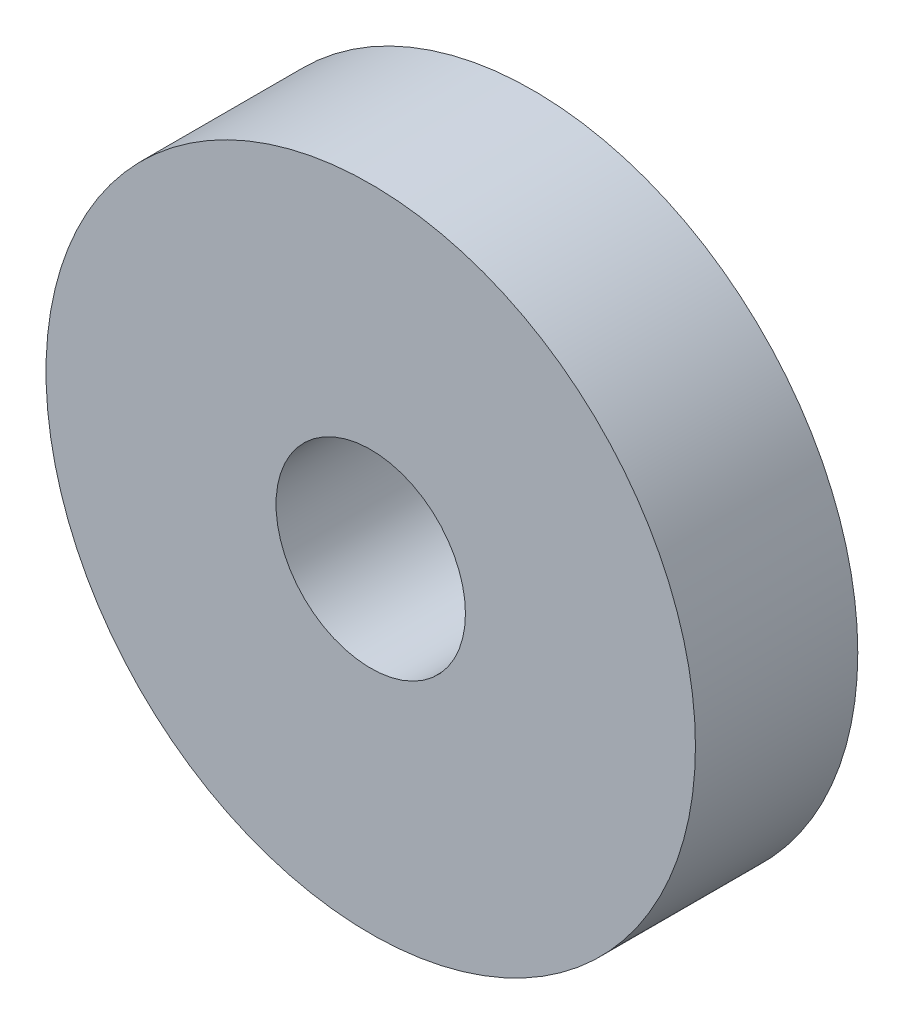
from build123d import *

# Parameters (mm, degrees)
ESQUISSE1_R        = 6
ESQUISSE1_R_2      = 1.75
BOSS_EXTRU_1_DEPTH = 3


with BuildPart() as part:
    # Esquisse1 → Boss.-Extru.1 (new body)
    with BuildSketch(Plane.XY):
        Circle(ESQUISSE1_R)
        Circle(ESQUISSE1_R_2, mode=Mode.SUBTRACT)
    extrude(amount=BOSS_EXTRU_1_DEPTH)


solid = part.part
